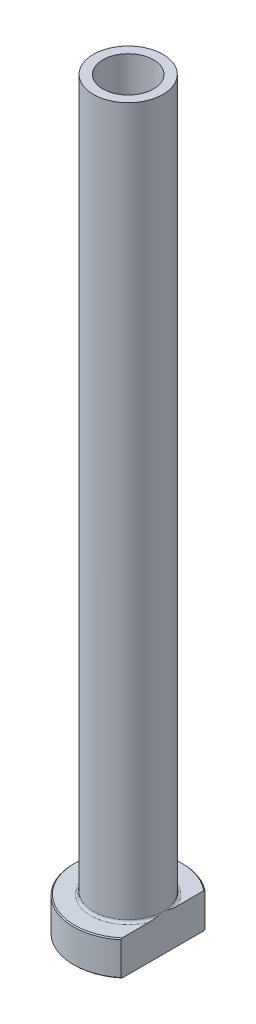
ISO-10303-21;
HEADER;
FILE_DESCRIPTION(('STEP AP214'),'2;1');
FILE_NAME('part.step','',(''),(''),'','','');
FILE_SCHEMA(('AUTOMOTIVE_DESIGN { 1 0 10303 214 1 1 1 1 }'));
ENDSEC;
DATA;
#1=APPLICATION_CONTEXT('core data for automotive mechanical design processes');
#2=APPLICATION_PROTOCOL_DEFINITION('international standard','automotive_design',2000,#1);
#3=PRODUCT_CONTEXT('',#1,'mechanical');
#4=PRODUCT('Part','Part','',(#3));
#5=PRODUCT_RELATED_PRODUCT_CATEGORY('part','',(#4));
#6=PRODUCT_DEFINITION_FORMATION('','',#4);
#7=PRODUCT_DEFINITION_CONTEXT('part definition',#1,'design');
#8=PRODUCT_DEFINITION('design','',#6,#7);
#9=PRODUCT_DEFINITION_SHAPE('','',#8);
#10=(LENGTH_UNIT() NAMED_UNIT(*) SI_UNIT(.MILLI.,.METRE.));
#11=(NAMED_UNIT(*) PLANE_ANGLE_UNIT() SI_UNIT($,.RADIAN.));
#12=(NAMED_UNIT(*) SI_UNIT($,.STERADIAN.) SOLID_ANGLE_UNIT());
#13=UNCERTAINTY_MEASURE_WITH_UNIT(LENGTH_MEASURE(1.E-05),#10,'distance_accuracy_value','');
#14=(GEOMETRIC_REPRESENTATION_CONTEXT(3) GLOBAL_UNCERTAINTY_ASSIGNED_CONTEXT((#13)) GLOBAL_UNIT_ASSIGNED_CONTEXT((#10,
#11,#12)) REPRESENTATION_CONTEXT('',''));
#15=CARTESIAN_POINT('',(0.,0.,0.));
#16=DIRECTION('',(0.,0.,1.));
#17=DIRECTION('',(1.,0.,0.));
#18=AXIS2_PLACEMENT_3D('',#15,#16,#17);
#19=CARTESIAN_POINT('',(0.,92.1876809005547,0.));
#20=DIRECTION('',(0.,1.,0.));
#21=DIRECTION('',(0.,0.,1.));
#22=AXIS2_PLACEMENT_3D('',#19,#20,#21);
#23=CYLINDRICAL_SURFACE('',#22,5.1);
#24=CARTESIAN_POINT('',(0.,150.,0.));
#25=DIRECTION('',(0.,1.,0.));
#26=DIRECTION('',(0.,0.,1.));
#27=AXIS2_PLACEMENT_3D('',#24,#25,#26);
#28=CIRCLE('',#27,5.1);
#29=CARTESIAN_POINT('',(0.,150.,5.1));
#30=VERTEX_POINT('',#29);
#31=EDGE_CURVE('E167',#30,#30,#28,.T.);
#32=ORIENTED_EDGE('',*,*,#31,.T.);
#33=EDGE_LOOP('',(#32));
#34=FACE_BOUND('',#33,.T.);
#35=CARTESIAN_POINT('',(0.,95.,0.));
#36=DIRECTION('',(0.,1.,0.));
#37=DIRECTION('',(0.,0.,1.));
#38=AXIS2_PLACEMENT_3D('',#35,#36,#37);
#39=CIRCLE('',#38,5.1);
#40=CARTESIAN_POINT('',(0.,95.,5.1));
#41=VERTEX_POINT('',#40);
#42=EDGE_CURVE('E170',#41,#41,#39,.T.);
#43=ORIENTED_EDGE('',*,*,#42,.F.);
#44=EDGE_LOOP('',(#43));
#45=FACE_BOUND('',#44,.T.);
#46=ADVANCED_FACE('F32',(#34,#45),#23,.F.);
#47=CARTESIAN_POINT('',(-5.1,150.,0.));
#48=DIRECTION('',(0.,1.,0.));
#49=DIRECTION('',(0.,0.,1.));
#50=AXIS2_PLACEMENT_3D('',#47,#48,#49);
#51=PLANE('',#50);
#52=CARTESIAN_POINT('',(0.,150.,0.));
#53=DIRECTION('',(0.,1.,0.));
#54=DIRECTION('',(0.,0.,1.));
#55=AXIS2_PLACEMENT_3D('',#52,#53,#54);
#56=CIRCLE('',#55,7.00000000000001);
#57=CARTESIAN_POINT('',(0.,150.,7.00000000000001));
#58=VERTEX_POINT('',#57);
#59=EDGE_CURVE('E174',#58,#58,#56,.T.);
#60=ORIENTED_EDGE('',*,*,#59,.T.);
#61=EDGE_LOOP('',(#60));
#62=FACE_BOUND('',#61,.T.);
#63=ORIENTED_EDGE('',*,*,#31,.F.);
#64=EDGE_LOOP('',(#63));
#65=FACE_BOUND('',#64,.T.);
#66=ADVANCED_FACE('F157',(#62,#65),#51,.T.);
#67=CARTESIAN_POINT('',(0.,92.1876809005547,0.));
#68=DIRECTION('',(0.,1.,0.));
#69=DIRECTION('',(0.,0.,1.));
#70=AXIS2_PLACEMENT_3D('',#67,#68,#69);
#71=CYLINDRICAL_SURFACE('',#70,7.);
#72=CARTESIAN_POINT('',(0.,7.50000000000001,0.));
#73=DIRECTION('',(0.,1.,0.));
#74=DIRECTION('',(0.,0.,1.));
#75=AXIS2_PLACEMENT_3D('',#72,#73,#74);
#76=CIRCLE('',#75,7.);
#77=CARTESIAN_POINT('',(7.,7.50000000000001,0.));
#78=VERTEX_POINT('',#77);
#79=EDGE_CURVE('E180',#78,#78,#76,.T.);
#80=ORIENTED_EDGE('',*,*,#79,.T.);
#81=EDGE_LOOP('',(#80));
#82=FACE_BOUND('',#81,.T.);
#83=ORIENTED_EDGE('',*,*,#59,.F.);
#84=EDGE_LOOP('',(#83));
#85=FACE_BOUND('',#84,.T.);
#86=ADVANCED_FACE('F162',(#82,#85),#71,.T.);
#87=CARTESIAN_POINT('',(-6.99999999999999,7.,0.));
#88=DIRECTION('',(0.,1.,0.));
#89=DIRECTION('',(0.,0.,1.));
#90=AXIS2_PLACEMENT_3D('',#87,#88,#89);
#91=PLANE('',#90);
#92=DIRECTION('',(0.,0.,1.));
#93=VECTOR('',#92,1.);
#94=CARTESIAN_POINT('',(6.99999999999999,7.,0.));
#95=LINE('',#94,#93);
#96=CARTESIAN_POINT('',(7.,7.,-8.22435407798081));
#97=VERTEX_POINT('',#96);
#98=CARTESIAN_POINT('',(6.99999999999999,7.,-2.69258240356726));
#99=VERTEX_POINT('',#98);
#100=EDGE_CURVE('E54',#97,#99,#95,.T.);
#101=ORIENTED_EDGE('',*,*,#100,.F.);
#102=CARTESIAN_POINT('',(0.,7.,0.));
#103=DIRECTION('',(0.,1.,0.));
#104=DIRECTION('',(0.,0.,1.));
#105=AXIS2_PLACEMENT_3D('',#102,#103,#104);
#106=CIRCLE('',#105,10.8);
#107=CARTESIAN_POINT('',(6.99999999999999,7.,8.22435407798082));
#108=VERTEX_POINT('',#107);
#109=EDGE_CURVE('E186',#97,#108,#106,.T.);
#110=ORIENTED_EDGE('',*,*,#109,.T.);
#111=CARTESIAN_POINT('',(6.99999999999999,7.,2.69258240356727));
#112=VERTEX_POINT('',#111);
#113=EDGE_CURVE('E134',#112,#108,#95,.T.);
#114=ORIENTED_EDGE('',*,*,#113,.F.);
#115=CARTESIAN_POINT('',(0.,7.,0.));
#116=DIRECTION('',(0.,1.,0.));
#117=DIRECTION('',(0.,0.,1.));
#118=AXIS2_PLACEMENT_3D('',#115,#116,#117);
#119=CIRCLE('',#118,7.5);
#120=EDGE_CURVE('E183',#112,#99,#119,.F.);
#121=ORIENTED_EDGE('',*,*,#120,.T.);
#122=EDGE_LOOP('',(#101,#110,#114,#121));
#123=FACE_BOUND('',#122,.T.);
#124=ADVANCED_FACE('F197',(#123),#91,.T.);
#125=CARTESIAN_POINT('',(0.,92.1876809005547,0.));
#126=DIRECTION('',(0.,1.,0.));
#127=DIRECTION('',(0.,0.,1.));
#128=AXIS2_PLACEMENT_3D('',#125,#126,#127);
#129=CYLINDRICAL_SURFACE('',#128,11.);
#130=DIRECTION('',(0.,-1.,0.));
#131=VECTOR('',#130,1.);
#132=CARTESIAN_POINT('',(6.99999999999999,150.,8.48528137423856));
#133=LINE('',#132,#131);
#134=CARTESIAN_POINT('',(6.99999999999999,6.79999999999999,8.48528137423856));
#135=VERTEX_POINT('',#134);
#136=CARTESIAN_POINT('',(6.99999999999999,0.200000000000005,8.48528137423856));
#137=VERTEX_POINT('',#136);
#138=EDGE_CURVE('E82',#135,#137,#133,.T.);
#139=ORIENTED_EDGE('',*,*,#138,.F.);
#140=CARTESIAN_POINT('',(0.,6.79999999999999,0.));
#141=DIRECTION('',(0.,1.,0.));
#142=DIRECTION('',(0.,0.,1.));
#143=AXIS2_PLACEMENT_3D('',#140,#141,#142);
#144=CIRCLE('',#143,11.);
#145=CARTESIAN_POINT('',(7.,6.79999999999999,-8.48528137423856));
#146=VERTEX_POINT('',#145);
#147=EDGE_CURVE('E95',#135,#146,#144,.F.);
#148=ORIENTED_EDGE('',*,*,#147,.T.);
#149=DIRECTION('',(0.,-1.,0.));
#150=VECTOR('',#149,1.);
#151=CARTESIAN_POINT('',(7.,150.,-8.48528137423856));
#152=LINE('',#151,#150);
#153=CARTESIAN_POINT('',(7.,0.200000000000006,-8.48528137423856));
#154=VERTEX_POINT('',#153);
#155=EDGE_CURVE('E192',#146,#154,#152,.T.);
#156=ORIENTED_EDGE('',*,*,#155,.T.);
#157=CARTESIAN_POINT('',(0.,0.200000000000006,0.));
#158=DIRECTION('',(0.,-1.,0.));
#159=DIRECTION('',(0.,0.,-1.));
#160=AXIS2_PLACEMENT_3D('',#157,#158,#159);
#161=CIRCLE('',#160,11.);
#162=EDGE_CURVE('E98',#154,#137,#161,.F.);
#163=ORIENTED_EDGE('',*,*,#162,.T.);
#164=EDGE_LOOP('',(#139,#148,#156,#163));
#165=FACE_BOUND('',#164,.T.);
#166=ADVANCED_FACE('F190',(#165),#129,.T.);
#167=CARTESIAN_POINT('',(-11.,0.,0.));
#168=DIRECTION('',(0.,-1.,0.));
#169=DIRECTION('',(0.,0.,-1.));
#170=AXIS2_PLACEMENT_3D('',#167,#168,#169);
#171=PLANE('',#170);
#172=CARTESIAN_POINT('',(0.,0.,0.));
#173=DIRECTION('',(0.,-1.,0.));
#174=DIRECTION('',(0.,0.,-1.));
#175=AXIS2_PLACEMENT_3D('',#172,#173,#174);
#176=CIRCLE('',#175,5.85000000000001);
#177=CARTESIAN_POINT('',(0.,0.,-5.85000000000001));
#178=VERTEX_POINT('',#177);
#179=EDGE_CURVE('E40',#178,#178,#176,.F.);
#180=ORIENTED_EDGE('',*,*,#179,.T.);
#181=EDGE_LOOP('',(#180));
#182=FACE_BOUND('',#181,.T.);
#183=DIRECTION('',(0.,0.,-1.));
#184=VECTOR('',#183,1.);
#185=CARTESIAN_POINT('',(6.99999999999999,0.,8.48528137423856));
#186=LINE('',#185,#184);
#187=CARTESIAN_POINT('',(6.99999999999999,0.,8.22435407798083));
#188=VERTEX_POINT('',#187);
#189=CARTESIAN_POINT('',(7.,0.,-8.22435407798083));
#190=VERTEX_POINT('',#189);
#191=EDGE_CURVE('E47',#188,#190,#186,.T.);
#192=ORIENTED_EDGE('',*,*,#191,.F.);
#193=CARTESIAN_POINT('',(0.,0.,0.));
#194=DIRECTION('',(0.,-1.,0.));
#195=DIRECTION('',(0.,0.,-1.));
#196=AXIS2_PLACEMENT_3D('',#193,#194,#195);
#197=CIRCLE('',#196,10.8);
#198=EDGE_CURVE('E92',#188,#190,#197,.T.);
#199=ORIENTED_EDGE('',*,*,#198,.T.);
#200=EDGE_LOOP('',(#192,#199));
#201=FACE_BOUND('',#200,.T.);
#202=ADVANCED_FACE('F91',(#182,#201),#171,.T.);
#203=CARTESIAN_POINT('',(0.,92.1876809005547,0.));
#204=DIRECTION('',(0.,1.,0.));
#205=DIRECTION('',(0.,0.,1.));
#206=AXIS2_PLACEMENT_3D('',#203,#204,#205);
#207=CYLINDRICAL_SURFACE('',#206,5.35);
#208=CARTESIAN_POINT('',(0.,0.500000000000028,0.));
#209=DIRECTION('',(0.,-1.,0.));
#210=DIRECTION('',(0.,0.,-1.));
#211=AXIS2_PLACEMENT_3D('',#208,#209,#210);
#212=CIRCLE('',#211,5.35);
#213=CARTESIAN_POINT('',(0.,0.500000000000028,-5.35));
#214=VERTEX_POINT('',#213);
#215=EDGE_CURVE('E11',#214,#214,#212,.T.);
#216=ORIENTED_EDGE('',*,*,#215,.T.);
#217=EDGE_LOOP('',(#216));
#218=FACE_BOUND('',#217,.T.);
#219=CARTESIAN_POINT('',(0.,83.,0.));
#220=DIRECTION('',(0.,1.,0.));
#221=DIRECTION('',(0.,0.,1.));
#222=AXIS2_PLACEMENT_3D('',#219,#220,#221);
#223=CIRCLE('',#222,5.35);
#224=CARTESIAN_POINT('',(0.,83.,5.35));
#225=VERTEX_POINT('',#224);
#226=EDGE_CURVE('E172',#225,#225,#223,.T.);
#227=ORIENTED_EDGE('',*,*,#226,.T.);
#228=EDGE_LOOP('',(#227));
#229=FACE_BOUND('',#228,.T.);
#230=ADVANCED_FACE('F215',(#218,#229),#207,.F.);
#231=CARTESIAN_POINT('',(0.,83.,0.));
#232=DIRECTION('',(0.,-1.,0.));
#233=DIRECTION('',(0.,0.,-1.));
#234=AXIS2_PLACEMENT_3D('',#231,#232,#233);
#235=CONICAL_SURFACE('',#234,5.35,0.0208303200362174);
#236=ORIENTED_EDGE('',*,*,#42,.T.);
#237=EDGE_LOOP('',(#236));
#238=FACE_BOUND('',#237,.T.);
#239=ORIENTED_EDGE('',*,*,#226,.F.);
#240=EDGE_LOOP('',(#239));
#241=FACE_BOUND('',#240,.T.);
#242=ADVANCED_FACE('F111',(#238,#241),#235,.F.);
#243=CARTESIAN_POINT('',(0.,7.50000000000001,0.));
#244=DIRECTION('',(0.,1.,0.));
#245=DIRECTION('',(0.,0.,1.));
#246=AXIS2_PLACEMENT_3D('',#243,#244,#245);
#247=TOROIDAL_SURFACE('',#246,7.5,0.5);
#248=ORIENTED_EDGE('',*,*,#120,.F.);
#249=CARTESIAN_POINT('',(7.,7.50000000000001,0.));
#250=CARTESIAN_POINT('',(7.,7.50000080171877,-1.25568479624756E-10));
#251=CARTESIAN_POINT('',(7.,7.50000160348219,2.9022028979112E-07));
#252=CARTESIAN_POINT('',(7.,7.50000310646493,1.10846445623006E-06));
#253=CARTESIAN_POINT('',(7.,7.50000379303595,1.65470117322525E-06));
#254=CARTESIAN_POINT('',(7.,7.50000521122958,2.96102760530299E-06));
#255=CARTESIAN_POINT('',(7.,7.50000592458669,3.74204187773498E-06));
#256=CARTESIAN_POINT('',(7.,7.50000721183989,5.36891885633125E-06));
#257=CARTESIAN_POINT('',(7.,7.50000778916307,6.21226355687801E-06));
#258=CARTESIAN_POINT('',(7.,7.50000990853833,9.44889721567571E-06));
#259=CARTESIAN_POINT('',(7.,7.50001133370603,1.19224915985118E-05));
#260=CARTESIAN_POINT('',(7.,7.50001370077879,1.68453050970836E-05));
#261=CARTESIAN_POINT('',(7.,7.50001467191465,1.92810864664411E-05));
#262=CARTESIAN_POINT('',(7.,7.5000187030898,2.95057529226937E-05));
#263=CARTESIAN_POINT('',(7.,7.50002167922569,3.73333827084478E-05));
#264=CARTESIAN_POINT('',(7.,7.5000261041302,5.21820419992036E-05));
#265=CARTESIAN_POINT('',(7.,7.50002771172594,5.91556020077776E-05));
#266=CARTESIAN_POINT('',(7.,7.50003935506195,0.000110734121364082));
#267=CARTESIAN_POINT('',(7.,7.50004810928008,0.000155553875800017));
#268=CARTESIAN_POINT('',(6.99999999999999,7.50008643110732,0.00033254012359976));
#269=CARTESIAN_POINT('',(6.99999999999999,7.50012307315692,0.000463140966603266));
#270=CARTESIAN_POINT('',(7.,7.50026565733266,0.000980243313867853));
#271=CARTESIAN_POINT('',(7.,7.50036696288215,0.00136762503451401));
#272=CARTESIAN_POINT('',(6.99999999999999,7.50077257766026,0.00290683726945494));
#273=CARTESIAN_POINT('',(6.99999999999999,7.5010826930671,0.00405753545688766));
#274=CARTESIAN_POINT('',(7.,7.50237341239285,0.00885983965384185));
#275=CARTESIAN_POINT('',(7.,7.50334676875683,0.0125128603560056));
#276=CARTESIAN_POINT('',(6.99999999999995,7.51627189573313,0.0610038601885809));
#277=CARTESIAN_POINT('',(6.99999999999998,7.52827280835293,0.105832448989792));
#278=CARTESIAN_POINT('',(7.00000000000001,7.551709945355,0.193693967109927));
#279=CARTESIAN_POINT('',(7.,7.56314936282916,0.236726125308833));
#280=CARTESIAN_POINT('',(6.99999999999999,7.58740418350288,0.328321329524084));
#281=CARTESIAN_POINT('',(6.99999999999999,7.60020832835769,0.376887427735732));
#282=CARTESIAN_POINT('',(7.,7.62578161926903,0.474605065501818));
#283=CARTESIAN_POINT('',(7.,7.63854879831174,0.523757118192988));
#284=CARTESIAN_POINT('',(6.99999999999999,7.66904753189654,0.642366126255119));
#285=CARTESIAN_POINT('',(7.,7.68665961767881,0.711854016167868));
#286=CARTESIAN_POINT('',(7.,7.72074501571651,0.849103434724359));
#287=CARTESIAN_POINT('',(7.,7.73723627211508,0.916860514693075));
#288=CARTESIAN_POINT('',(7.,7.79038156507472,1.1410421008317));
#289=CARTESIAN_POINT('',(7.,7.82528973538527,1.29788860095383));
#290=CARTESIAN_POINT('',(7.,7.88862298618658,1.61471917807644));
#291=CARTESIAN_POINT('',(7.,7.91697354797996,1.77471883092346));
#292=CARTESIAN_POINT('',(7.,7.95258292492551,2.02253505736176));
#293=CARTESIAN_POINT('',(7.,7.96355251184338,2.10981398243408));
#294=CARTESIAN_POINT('',(7.,7.98165287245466,2.28476193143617));
#295=CARTESIAN_POINT('',(7.,7.98878459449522,2.37243085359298));
#296=CARTESIAN_POINT('',(7.,7.99822919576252,2.54760327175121));
#297=CARTESIAN_POINT('',(7.,8.00056589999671,2.63510541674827));
#298=CARTESIAN_POINT('',(7.,7.99919996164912,2.81004074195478));
#299=CARTESIAN_POINT('',(7.,7.99550272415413,2.89747391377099));
#300=CARTESIAN_POINT('',(7.,7.98391011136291,3.02882076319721));
#301=CARTESIAN_POINT('',(7.,7.9789723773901,3.0729968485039));
#302=CARTESIAN_POINT('',(7.,7.96665453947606,3.16105400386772));
#303=CARTESIAN_POINT('',(7.,7.9592724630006,3.20493480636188));
#304=CARTESIAN_POINT('',(7.,7.94168688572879,3.29163191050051));
#305=CARTESIAN_POINT('',(7.,7.93151559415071,3.3344546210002));
#306=CARTESIAN_POINT('',(7.,7.90768392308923,3.41909658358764));
#307=CARTESIAN_POINT('',(7.,7.89402748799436,3.46091691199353));
#308=CARTESIAN_POINT('',(7.,7.86214701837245,3.54331777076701));
#309=CARTESIAN_POINT('',(7.,7.84387618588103,3.58388050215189));
#310=CARTESIAN_POINT('',(7.,7.80145892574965,3.66184445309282));
#311=CARTESIAN_POINT('',(7.,7.77733569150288,3.69925738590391));
#312=CARTESIAN_POINT('',(7.,7.73714014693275,3.74836513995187));
#313=CARTESIAN_POINT('',(7.,7.72423208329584,3.76263695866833));
#314=CARTESIAN_POINT('',(7.,7.69673765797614,3.78951670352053));
#315=CARTESIAN_POINT('',(7.,7.68215013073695,3.80212346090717));
#316=CARTESIAN_POINT('',(7.,7.65099843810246,3.82514624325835));
#317=CARTESIAN_POINT('',(7.,7.63441049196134,3.83553078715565));
#318=CARTESIAN_POINT('',(7.,7.59955798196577,3.8529401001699));
#319=CARTESIAN_POINT('',(7.,7.58129885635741,3.85997533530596));
#320=CARTESIAN_POINT('',(7.,7.54906837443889,3.86837810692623));
#321=CARTESIAN_POINT('',(7.,7.53536870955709,3.87079233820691));
#322=CARTESIAN_POINT('',(7.,7.50775756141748,3.87325240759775));
#323=CARTESIAN_POINT('',(7.,7.4938461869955,3.87329942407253));
#324=CARTESIAN_POINT('',(7.,7.46623771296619,3.87102093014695));
#325=CARTESIAN_POINT('',(7.,7.45254041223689,3.8686978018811));
#326=CARTESIAN_POINT('',(7.,7.42569741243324,3.86188775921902));
#327=CARTESIAN_POINT('',(7.,7.41255212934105,3.85739924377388));
#328=CARTESIAN_POINT('',(7.,7.3825931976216,3.84468786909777));
#329=CARTESIAN_POINT('',(7.,7.36610215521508,3.83570823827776));
#330=CARTESIAN_POINT('',(7.,7.33476729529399,3.81523202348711));
#331=CARTESIAN_POINT('',(7.,7.31992737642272,3.80372966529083));
#332=CARTESIAN_POINT('',(7.,7.28371925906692,3.77170797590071));
#333=CARTESIAN_POINT('',(7.,7.26356272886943,3.74983059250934));
#334=CARTESIAN_POINT('',(7.,7.22671696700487,3.70338283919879));
#335=CARTESIAN_POINT('',(7.,7.2100336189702,3.67880800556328));
#336=CARTESIAN_POINT('',(7.,7.18026553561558,3.62921731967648));
#337=CARTESIAN_POINT('',(7.,7.16704475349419,3.60428175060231));
#338=CARTESIAN_POINT('',(7.,7.14275069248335,3.55337478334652));
#339=CARTESIAN_POINT('',(7.,7.1316794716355,3.52740242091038));
#340=CARTESIAN_POINT('',(7.,7.10104499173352,3.44809573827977));
#341=CARTESIAN_POINT('',(7.,7.08424174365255,3.39369851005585));
#342=CARTESIAN_POINT('',(7.,7.05431378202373,3.27667221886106));
#343=CARTESIAN_POINT('',(7.,7.04191718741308,3.21386807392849));
#344=CARTESIAN_POINT('',(7.,7.02234605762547,3.08735184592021));
#345=CARTESIAN_POINT('',(7.,7.01518234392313,3.0236381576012));
#346=CARTESIAN_POINT('',(7.,7.00517826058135,2.8977900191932));
#347=CARTESIAN_POINT('',(7.,7.00221627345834,2.8356646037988));
#348=CARTESIAN_POINT('',(7.,6.99952325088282,2.71160626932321));
#349=CARTESIAN_POINT('',(7.,6.99977918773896,2.64967358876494));
#350=CARTESIAN_POINT('',(7.,7.00377761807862,2.49407814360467));
#351=CARTESIAN_POINT('',(7.,7.00924384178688,2.40046113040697));
#352=CARTESIAN_POINT('',(7.,7.02494106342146,2.21367396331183));
#353=CARTESIAN_POINT('',(7.,7.0351710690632,2.12050372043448));
#354=CARTESIAN_POINT('',(7.,7.05969765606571,1.93249035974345));
#355=CARTESIAN_POINT('',(7.,7.07408383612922,1.83765914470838));
#356=CARTESIAN_POINT('',(7.,7.1060330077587,1.6482934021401));
#357=CARTESIAN_POINT('',(7.,7.12360402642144,1.55376025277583));
#358=CARTESIAN_POINT('',(7.,7.16806468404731,1.33086107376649));
#359=CARTESIAN_POINT('',(7.,7.19601783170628,1.20270896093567));
#360=CARTESIAN_POINT('',(7.,7.25475947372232,0.948586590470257));
#361=CARTESIAN_POINT('',(7.,7.28551257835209,0.822607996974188));
#362=CARTESIAN_POINT('',(7.,7.33123897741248,0.64133402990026));
#363=CARTESIAN_POINT('',(7.,7.34543722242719,0.585840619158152));
#364=CARTESIAN_POINT('',(6.99999999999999,7.37418243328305,0.474686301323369));
#365=CARTESIAN_POINT('',(6.99999999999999,7.38873064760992,0.419025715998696));
#366=CARTESIAN_POINT('',(7.,7.41873357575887,0.305011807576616));
#367=CARTESIAN_POINT('',(7.,7.43419762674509,0.246660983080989));
#368=CARTESIAN_POINT('',(6.99999999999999,7.46502361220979,0.130933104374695));
#369=CARTESIAN_POINT('',(6.99999999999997,7.48038319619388,0.073555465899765));
#370=CARTESIAN_POINT('',(7.,7.49665455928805,0.0125077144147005));
#371=CARTESIAN_POINT('',(7.,7.49762931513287,0.00884956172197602));
#372=CARTESIAN_POINT('',(6.99999999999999,7.49892036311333,0.00404608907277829));
#373=CARTESIAN_POINT('',(6.99999999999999,7.49922940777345,0.00289935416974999));
#374=CARTESIAN_POINT('',(7.,7.49963371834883,0.00136508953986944));
#375=CARTESIAN_POINT('',(7.,7.49973476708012,0.000978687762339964));
#376=CARTESIAN_POINT('',(6.99999999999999,7.49987704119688,0.00046273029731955));
#377=CARTESIAN_POINT('',(6.99999999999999,7.4999136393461,0.000332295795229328));
#378=CARTESIAN_POINT('',(7.,7.49995192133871,0.000155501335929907));
#379=CARTESIAN_POINT('',(7.,7.49996067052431,0.000110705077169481));
#380=CARTESIAN_POINT('',(7.,7.49997230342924,5.91504871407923E-05));
#381=CARTESIAN_POINT('',(7.,7.49997390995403,5.21782476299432E-05));
#382=CARTESIAN_POINT('',(7.,7.49997833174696,3.73322821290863E-05));
#383=CARTESIAN_POINT('',(7.,7.49998130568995,2.95059555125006E-05));
#384=CARTESIAN_POINT('',(7.,7.49998533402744,1.92826357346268E-05));
#385=CARTESIAN_POINT('',(7.,7.49998630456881,1.68469531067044E-05));
#386=CARTESIAN_POINT('',(7.,7.49998867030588,1.19242379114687E-05));
#387=CARTESIAN_POINT('',(7.,7.49999009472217,9.45063101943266E-06));
#388=CARTESIAN_POINT('',(7.,7.49999221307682,6.21386478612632E-06));
#389=CARTESIAN_POINT('',(7.,7.4999927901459,5.37045339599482E-06));
#390=CARTESIAN_POINT('',(7.,7.49999407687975,3.74339717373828E-06));
#391=CARTESIAN_POINT('',(7.,7.49999478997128,2.96226879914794E-06));
#392=CARTESIAN_POINT('',(7.,7.49999620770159,1.65567359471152E-06));
#393=CARTESIAN_POINT('',(7.,7.49999689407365,1.10929204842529E-06));
#394=CARTESIAN_POINT('',(7.,7.49999839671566,2.90683225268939E-07));
#395=CARTESIAN_POINT('',(7.,7.49999919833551,1.25561410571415E-10));
#396=CARTESIAN_POINT('',(7.,7.50000000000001,0.));
#397=B_SPLINE_CURVE_WITH_KNOTS('',3,(#249,#250,#251,#252,#253,#254,#255,#256,#257,#258,#259,
#260,#261,#262,#263,#264,#265,#266,#267,#268,#269,#270,#271,#272,#273,#274,#275,#276,#277,#278,
#279,#280,#281,#282,#283,#284,#285,#286,#287,#288,#289,#290,#291,#292,#293,#294,#295,#296,#297,
#298,#299,#300,#301,#302,#303,#304,#305,#306,#307,#308,#309,#310,#311,#312,#313,#314,#315,#316,
#317,#318,#319,#320,#321,#322,#323,#324,#325,#326,#327,#328,#329,#330,#331,#332,#333,#334,#335,
#336,#337,#338,#339,#340,#341,#342,#343,#344,#345,#346,#347,#348,#349,#350,#351,#352,#353,#354,
#355,#356,#357,#358,#359,#360,#361,#362,#363,#364,#365,#366,#367,#368,#369,#370,#371,#372,#373,
#374,#375,#376,#377,#378,#379,#380,#381,#382,#383,#384,#385,#386,#387,#388,#389,#390,#391,#392,
#393,#394,#395,#396),.UNSPECIFIED.,.T.,.F.,(4,2,2,2,2,2,2,2,2,2,2,2,2,2,2,2,2,2,2,2,2,2,2,2,2,2,
2,2,2,2,2,2,2,2,2,2,2,2,2,2,2,2,2,2,2,2,2,2,2,2,2,2,2,2,2,2,2,2,2,2,2,2,2,2,2,2,2,2,2,2,2,2,2,
4),(0.,2.42201381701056E-06,5.0530479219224E-06,8.20814016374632E-06,1.12722920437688E-05,
1.98044004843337E-05,2.76642048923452E-05,5.27403832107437E-05,7.41830767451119E-05,
0.000211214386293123,0.000617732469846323,0.00181938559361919,0.00539412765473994,
0.016736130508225,0.155952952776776,0.2895341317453,0.440210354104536,0.592559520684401,
0.807611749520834,1.0168149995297,1.49878389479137,1.98598665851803,2.24981935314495,
2.5135868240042,2.77604050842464,3.03825922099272,3.17156039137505,3.3049693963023,
3.43689837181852,3.5686786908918,3.70185328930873,3.83450849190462,3.89212877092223,
3.94978928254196,4.00821928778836,4.06646549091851,4.10801107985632,4.14953598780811,
4.19101920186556,4.23253313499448,4.28854866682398,4.34469377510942,4.4334341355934,
4.52232362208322,4.60686785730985,4.69149264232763,4.86185145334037,5.05362927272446,
5.24580256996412,5.43229132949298,5.61802533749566,5.89918385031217,6.18028382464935,
6.46796485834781,6.75638131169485,7.14981284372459,7.53882346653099,7.71066604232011,
7.88325629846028,8.0643532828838,8.24254095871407,8.25389891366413,8.25746134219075,
8.25865995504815,8.25906595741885,8.25920291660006,8.25922435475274,8.25924942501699,
8.25925728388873,8.25926581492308,8.25926887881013,8.25927203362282,8.25927466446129,
8.25927708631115),.UNSPECIFIED.);
#398=EDGE_CURVE('E126',#112,#78,#397,.T.);
#399=ORIENTED_EDGE('',*,*,#398,.T.);
#400=ORIENTED_EDGE('',*,*,#79,.F.);
#401=CARTESIAN_POINT('',(7.,7.50000000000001,0.));
#402=CARTESIAN_POINT('',(7.,7.49999919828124,1.25569885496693E-10));
#403=CARTESIAN_POINT('',(7.,7.49999839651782,-2.90220288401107E-07));
#404=CARTESIAN_POINT('',(7.,7.49999689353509,-1.10846445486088E-06));
#405=CARTESIAN_POINT('',(7.,7.49999620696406,-1.65470117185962E-06));
#406=CARTESIAN_POINT('',(7.,7.49999478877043,-2.96102760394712E-06));
#407=CARTESIAN_POINT('',(7.,7.49999407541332,-3.7420418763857E-06));
#408=CARTESIAN_POINT('',(7.,7.49999278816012,-5.36891885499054E-06));
#409=CARTESIAN_POINT('',(7.,7.49999221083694,-6.2122635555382E-06));
#410=CARTESIAN_POINT('',(7.,7.49999009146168,-9.44889721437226E-06));
#411=CARTESIAN_POINT('',(7.,7.49998866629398,-1.19224915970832E-05));
#412=CARTESIAN_POINT('',(7.,7.49998629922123,-1.68453050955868E-05));
#413=CARTESIAN_POINT('',(7.,7.49998532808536,-1.92810864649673E-05));
#414=CARTESIAN_POINT('',(7.,7.49998129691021,-2.950575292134E-05));
#415=CARTESIAN_POINT('',(7.,7.49997832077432,-3.73333827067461E-05));
#416=CARTESIAN_POINT('',(7.,7.49997389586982,-5.21820419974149E-05));
#417=CARTESIAN_POINT('',(7.,7.49997228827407,-5.91556020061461E-05));
#418=CARTESIAN_POINT('',(7.,7.49996064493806,-0.000110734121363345));
#419=CARTESIAN_POINT('',(7.,7.49995189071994,-0.000155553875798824));
#420=CARTESIAN_POINT('',(6.99999999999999,7.49991356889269,-0.000332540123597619));
#421=CARTESIAN_POINT('',(6.99999999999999,7.49987692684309,-0.00046314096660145));
#422=CARTESIAN_POINT('',(7.,7.49973434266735,-0.000980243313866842));
#423=CARTESIAN_POINT('',(7.,7.49963303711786,-0.00136762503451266));
#424=CARTESIAN_POINT('',(6.99999999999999,7.49922742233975,-0.0029068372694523));
#425=CARTESIAN_POINT('',(6.99999999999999,7.49891730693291,-0.00405753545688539));
#426=CARTESIAN_POINT('',(7.,7.49762658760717,-0.00885983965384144));
#427=CARTESIAN_POINT('',(7.,7.49665323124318,-0.0125128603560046));
#428=CARTESIAN_POINT('',(6.99999999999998,7.48372810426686,-0.0610038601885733));
#429=CARTESIAN_POINT('',(6.99999999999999,7.47172719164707,-0.105832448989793));
#430=CARTESIAN_POINT('',(7.,7.44829005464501,-0.193693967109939));
#431=CARTESIAN_POINT('',(7.,7.43685063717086,-0.236726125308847));
#432=CARTESIAN_POINT('',(6.99999999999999,7.41259581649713,-0.328321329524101));
#433=CARTESIAN_POINT('',(7.,7.39979167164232,-0.376887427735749));
#434=CARTESIAN_POINT('',(7.,7.37421838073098,-0.474605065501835));
#435=CARTESIAN_POINT('',(7.,7.36145120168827,-0.523757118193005));
#436=CARTESIAN_POINT('',(7.,7.33095246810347,-0.642366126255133));
#437=CARTESIAN_POINT('',(7.,7.3133403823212,-0.711854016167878));
#438=CARTESIAN_POINT('',(7.,7.2792549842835,-0.849103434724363));
#439=CARTESIAN_POINT('',(7.,7.26276372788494,-0.916860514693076));
#440=CARTESIAN_POINT('',(7.,7.20961843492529,-1.1410421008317));
#441=CARTESIAN_POINT('',(7.,7.17471026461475,-1.29788860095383));
#442=CARTESIAN_POINT('',(7.,7.11137701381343,-1.61471917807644));
#443=CARTESIAN_POINT('',(7.,7.08302645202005,-1.77471883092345));
#444=CARTESIAN_POINT('',(7.,7.0474170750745,-2.02253505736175));
#445=CARTESIAN_POINT('',(7.,7.03644748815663,-2.10981398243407));
#446=CARTESIAN_POINT('',(7.,7.01834712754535,-2.28476193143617));
#447=CARTESIAN_POINT('',(7.,7.01121540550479,-2.37243085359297));
#448=CARTESIAN_POINT('',(7.,7.00177080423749,-2.5476032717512));
#449=CARTESIAN_POINT('',(7.,6.9994341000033,-2.63510541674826));
#450=CARTESIAN_POINT('',(7.,7.00080003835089,-2.81004074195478));
#451=CARTESIAN_POINT('',(7.,7.00449727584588,-2.89747391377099));
#452=CARTESIAN_POINT('',(7.,7.01608988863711,-3.02882076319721));
#453=CARTESIAN_POINT('',(7.,7.02102762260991,-3.0729968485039));
#454=CARTESIAN_POINT('',(7.,7.03334546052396,-3.16105400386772));
#455=CARTESIAN_POINT('',(7.,7.04072753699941,-3.20493480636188));
#456=CARTESIAN_POINT('',(7.,7.05831311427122,-3.29163191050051));
#457=CARTESIAN_POINT('',(7.,7.06848440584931,-3.3344546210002));
#458=CARTESIAN_POINT('',(7.,7.09231607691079,-3.41909658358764));
#459=CARTESIAN_POINT('',(7.,7.10597251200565,-3.46091691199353));
#460=CARTESIAN_POINT('',(7.,7.13785298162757,-3.54331777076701));
#461=CARTESIAN_POINT('',(7.,7.15612381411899,-3.58388050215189));
#462=CARTESIAN_POINT('',(7.,7.19854107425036,-3.66184445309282));
#463=CARTESIAN_POINT('',(7.,7.22266430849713,-3.69925738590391));
#464=CARTESIAN_POINT('',(7.,7.26285985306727,-3.74836513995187));
#465=CARTESIAN_POINT('',(7.,7.27576791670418,-3.76263695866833));
#466=CARTESIAN_POINT('',(7.,7.30326234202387,-3.78951670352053));
#467=CARTESIAN_POINT('',(7.,7.31784986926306,-3.80212346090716));
#468=CARTESIAN_POINT('',(7.,7.34900156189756,-3.82514624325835));
#469=CARTESIAN_POINT('',(7.,7.36558950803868,-3.83553078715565));
#470=CARTESIAN_POINT('',(7.,7.40044201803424,-3.8529401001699));
#471=CARTESIAN_POINT('',(7.,7.4187011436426,-3.85997533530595));
#472=CARTESIAN_POINT('',(7.,7.45093162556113,-3.86837810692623));
#473=CARTESIAN_POINT('',(7.,7.46463129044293,-3.87079233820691));
#474=CARTESIAN_POINT('',(7.,7.49224243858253,-3.87325240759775));
#475=CARTESIAN_POINT('',(7.,7.50615381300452,-3.87329942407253));
#476=CARTESIAN_POINT('',(7.,7.53376228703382,-3.87102093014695));
#477=CARTESIAN_POINT('',(7.,7.54745958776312,-3.8686978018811));
#478=CARTESIAN_POINT('',(7.,7.57430258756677,-3.86188775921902));
#479=CARTESIAN_POINT('',(7.,7.58744787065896,-3.85739924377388));
#480=CARTESIAN_POINT('',(7.,7.61740680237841,-3.84468786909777));
#481=CARTESIAN_POINT('',(7.,7.63389784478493,-3.83570823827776));
#482=CARTESIAN_POINT('',(7.,7.66523270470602,-3.81523202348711));
#483=CARTESIAN_POINT('',(7.,7.68007262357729,-3.80372966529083));
#484=CARTESIAN_POINT('',(7.,7.71628074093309,-3.77170797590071));
#485=CARTESIAN_POINT('',(7.,7.73643727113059,-3.74983059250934));
#486=CARTESIAN_POINT('',(7.,7.77328303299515,-3.70338283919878));
#487=CARTESIAN_POINT('',(7.,7.78996638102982,-3.67880800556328));
#488=CARTESIAN_POINT('',(7.,7.81973446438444,-3.62921731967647));
#489=CARTESIAN_POINT('',(7.,7.83295524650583,-3.6042817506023));
#490=CARTESIAN_POINT('',(7.,7.85724930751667,-3.55337478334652));
#491=CARTESIAN_POINT('',(7.,7.86832052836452,-3.52740242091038));
#492=CARTESIAN_POINT('',(7.,7.89895500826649,-3.44809573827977));
#493=CARTESIAN_POINT('',(7.,7.91575825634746,-3.39369851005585));
#494=CARTESIAN_POINT('',(7.,7.94568621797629,-3.27667221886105));
#495=CARTESIAN_POINT('',(7.,7.95808281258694,-3.21386807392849));
#496=CARTESIAN_POINT('',(7.,7.97765394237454,-3.0873518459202));
#497=CARTESIAN_POINT('',(7.,7.98481765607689,-3.02363815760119));
#498=CARTESIAN_POINT('',(7.,7.99482173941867,-2.89779001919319));
#499=CARTESIAN_POINT('',(7.,7.99778372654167,-2.83566460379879));
#500=CARTESIAN_POINT('',(7.,8.0004767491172,-2.71160626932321));
#501=CARTESIAN_POINT('',(7.,8.00022081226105,-2.64967358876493));
#502=CARTESIAN_POINT('',(7.,7.99622238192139,-2.49407814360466));
#503=CARTESIAN_POINT('',(7.,7.99075615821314,-2.40046113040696));
#504=CARTESIAN_POINT('',(7.,7.97505893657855,-2.21367396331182));
#505=CARTESIAN_POINT('',(7.,7.96482893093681,-2.12050372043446));
#506=CARTESIAN_POINT('',(7.,7.9403023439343,-1.93249035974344));
#507=CARTESIAN_POINT('',(7.,7.92591616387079,-1.83765914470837));
#508=CARTESIAN_POINT('',(7.,7.89396699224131,-1.64829340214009));
#509=CARTESIAN_POINT('',(7.,7.87639597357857,-1.55376025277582));
#510=CARTESIAN_POINT('',(7.,7.8319353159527,-1.33086107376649));
#511=CARTESIAN_POINT('',(7.,7.80398216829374,-1.20270896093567));
#512=CARTESIAN_POINT('',(7.,7.7452405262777,-0.948586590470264));
#513=CARTESIAN_POINT('',(7.,7.71448742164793,-0.822607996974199));
#514=CARTESIAN_POINT('',(7.,7.66876102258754,-0.641334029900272));
#515=CARTESIAN_POINT('',(7.,7.65456277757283,-0.585840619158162));
#516=CARTESIAN_POINT('',(6.99999999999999,7.62581756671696,-0.474686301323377));
#517=CARTESIAN_POINT('',(6.99999999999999,7.61126935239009,-0.419025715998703));
#518=CARTESIAN_POINT('',(7.,7.58126642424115,-0.305011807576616));
#519=CARTESIAN_POINT('',(7.,7.56580237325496,-0.246660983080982));
#520=CARTESIAN_POINT('',(6.99999999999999,7.53497638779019,-0.130933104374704));
#521=CARTESIAN_POINT('',(6.99999999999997,7.519616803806,-0.0735554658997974));
#522=CARTESIAN_POINT('',(7.,7.50334544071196,-0.0125077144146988));
#523=CARTESIAN_POINT('',(7.,7.50237068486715,-0.00884956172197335));
#524=CARTESIAN_POINT('',(6.99999999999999,7.50107963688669,-0.00404608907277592));
#525=CARTESIAN_POINT('',(6.99999999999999,7.50077059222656,-0.00289935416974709));
#526=CARTESIAN_POINT('',(7.,7.50036628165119,-0.00136508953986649));
#527=CARTESIAN_POINT('',(7.,7.50026523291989,-0.000978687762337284));
#528=CARTESIAN_POINT('',(6.99999999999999,7.50012295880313,-0.000462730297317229));
#529=CARTESIAN_POINT('',(6.99999999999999,7.50008636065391,-0.000332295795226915));
#530=CARTESIAN_POINT('',(7.,7.50004807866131,-0.000155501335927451));
#531=CARTESIAN_POINT('',(7.,7.50003932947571,-0.000110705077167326));
#532=CARTESIAN_POINT('',(7.,7.50002769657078,-5.91504871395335E-05));
#533=CARTESIAN_POINT('',(7.,7.50002609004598,-5.21782476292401E-05));
#534=CARTESIAN_POINT('',(7.,7.50002166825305,-3.73322821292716E-05));
#535=CARTESIAN_POINT('',(7.,7.50001869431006,-2.95059555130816E-05));
#536=CARTESIAN_POINT('',(7.,7.50001466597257,-1.9282635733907E-05));
#537=CARTESIAN_POINT('',(7.,7.5000136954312,-1.68469531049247E-05));
#538=CARTESIAN_POINT('',(7.,7.50001132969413,-1.19242379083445E-05));
#539=CARTESIAN_POINT('',(7.,7.50000990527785,-9.45063101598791E-06));
#540=CARTESIAN_POINT('',(7.,7.50000778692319,-6.21386478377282E-06));
#541=CARTESIAN_POINT('',(7.,7.50000720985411,-5.3704533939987E-06));
#542=CARTESIAN_POINT('',(7.,7.50000592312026,-3.74339717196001E-06));
#543=CARTESIAN_POINT('',(7.,7.50000521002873,-2.96226879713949E-06));
#544=CARTESIAN_POINT('',(7.,7.50000379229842,-1.65567359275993E-06));
#545=CARTESIAN_POINT('',(7.,7.50000310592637,-1.10929204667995E-06));
#546=CARTESIAN_POINT('',(7.,7.50000160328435,-2.9068322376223E-07));
#547=CARTESIAN_POINT('',(7.,7.5000008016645,-1.25559954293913E-10));
#548=CARTESIAN_POINT('',(7.,7.50000000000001,0.));
#549=B_SPLINE_CURVE_WITH_KNOTS('',3,(#401,#402,#403,#404,#405,#406,#407,#408,#409,#410,#411,
#412,#413,#414,#415,#416,#417,#418,#419,#420,#421,#422,#423,#424,#425,#426,#427,#428,#429,#430,
#431,#432,#433,#434,#435,#436,#437,#438,#439,#440,#441,#442,#443,#444,#445,#446,#447,#448,#449,
#450,#451,#452,#453,#454,#455,#456,#457,#458,#459,#460,#461,#462,#463,#464,#465,#466,#467,#468,
#469,#470,#471,#472,#473,#474,#475,#476,#477,#478,#479,#480,#481,#482,#483,#484,#485,#486,#487,
#488,#489,#490,#491,#492,#493,#494,#495,#496,#497,#498,#499,#500,#501,#502,#503,#504,#505,#506,
#507,#508,#509,#510,#511,#512,#513,#514,#515,#516,#517,#518,#519,#520,#521,#522,#523,#524,#525,
#526,#527,#528,#529,#530,#531,#532,#533,#534,#535,#536,#537,#538,#539,#540,#541,#542,#543,#544,
#545,#546,#547,#548),.UNSPECIFIED.,.T.,.F.,(4,2,2,2,2,2,2,2,2,2,2,2,2,2,2,2,2,2,2,2,2,2,2,2,2,2,
2,2,2,2,2,2,2,2,2,2,2,2,2,2,2,2,2,2,2,2,2,2,2,2,2,2,2,2,2,2,2,2,2,2,2,2,2,2,2,2,2,2,2,2,2,2,2,
4),(0.,2.42201381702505E-06,5.05304792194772E-06,8.20814016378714E-06,1.12722920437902E-05,
1.98044004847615E-05,2.7664204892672E-05,5.27403832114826E-05,7.41830767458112E-05,
0.000211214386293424,0.000617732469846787,0.00181938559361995,0.00539412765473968,
0.0167361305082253,0.155952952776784,0.289534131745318,0.440210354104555,0.592559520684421,
0.807611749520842,1.0168149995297,1.49878389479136,1.98598665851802,2.24981935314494,
2.5135868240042,2.77604050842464,3.03825922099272,3.17156039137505,3.3049693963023,
3.43689837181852,3.5686786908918,3.70185328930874,3.83450849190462,3.89212877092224,
3.94978928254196,4.00821928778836,4.06646549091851,4.10801107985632,4.14953598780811,
4.19101920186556,4.23253313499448,4.28854866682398,4.34469377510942,4.4334341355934,
4.52232362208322,4.60686785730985,4.69149264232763,4.86185145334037,5.05362927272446,
5.24580256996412,5.43229132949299,5.61802533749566,5.89918385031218,6.18028382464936,
6.46796485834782,6.75638131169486,7.14981284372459,7.53882346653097,7.7106660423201,
7.88325629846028,8.0643532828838,8.24254095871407,8.25389891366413,8.25746134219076,
8.25865995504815,8.25906595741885,8.25920291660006,8.25922435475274,8.25924942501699,
8.25925728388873,8.25926581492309,8.25926887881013,8.25927203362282,8.25927466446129,
8.25927708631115),.UNSPECIFIED.);
#550=EDGE_CURVE('E135',#78,#99,#549,.T.);
#551=ORIENTED_EDGE('',*,*,#550,.T.);
#552=EDGE_LOOP('',(#248,#399,#400,#551));
#553=FACE_BOUND('',#552,.T.);
#554=ADVANCED_FACE('F141',(#553),#247,.F.);
#555=CARTESIAN_POINT('',(0.,7.00000000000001,0.));
#556=DIRECTION('',(0.,-1.,0.));
#557=DIRECTION('',(0.,0.,-1.));
#558=AXIS2_PLACEMENT_3D('',#555,#556,#557);
#559=CONICAL_SURFACE('',#558,10.8,0.785398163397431);
#560=CARTESIAN_POINT('',(7.,-2.13774979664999,-18.6685261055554));
#561=CARTESIAN_POINT('',(7.,-1.86574872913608,-18.3780244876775));
#562=CARTESIAN_POINT('',(7.,-1.59415659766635,-18.0871392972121));
#563=CARTESIAN_POINT('',(7.,-1.05192877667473,-17.5044755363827));
#564=CARTESIAN_POINT('',(7.,-0.781293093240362,-17.2126969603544));
#565=CARTESIAN_POINT('',(7.,-0.241050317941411,-16.628048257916));
#566=CARTESIAN_POINT('',(7.,0.0285564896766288,-16.3351778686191));
#567=CARTESIAN_POINT('',(7.,0.566485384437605,-15.7482616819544));
#568=CARTESIAN_POINT('',(7.,0.834807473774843,-15.4542158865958));
#569=CARTESIAN_POINT('',(7.,1.64198377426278,-14.5651645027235));
#570=CARTESIAN_POINT('',(7.,2.17856420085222,-13.9680841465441));
#571=CARTESIAN_POINT('',(7.,2.97696333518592,-13.0668144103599));
#572=CARTESIAN_POINT('',(7.,3.24199785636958,-12.7654727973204));
#573=CARTESIAN_POINT('',(7.,3.76945856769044,-12.1605141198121));
#574=CARTESIAN_POINT('',(7.,4.0318847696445,-11.856897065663));
#575=CARTESIAN_POINT('',(7.,4.50733797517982,-11.3009625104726));
#576=CARTESIAN_POINT('',(7.,4.7208802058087,-11.0490858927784));
#577=CARTESIAN_POINT('',(7.,5.14538078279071,-10.5431655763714));
#578=CARTESIAN_POINT('',(7.,5.35633915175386,-10.2891218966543));
#579=CARTESIAN_POINT('',(7.,5.77522964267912,-9.77836737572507));
#580=CARTESIAN_POINT('',(7.,5.98316044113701,-9.52165544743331));
#581=CARTESIAN_POINT('',(7.,6.39521098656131,-9.0051908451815));
#582=CARTESIAN_POINT('',(7.,6.59933078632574,-8.74543821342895));
#583=CARTESIAN_POINT('',(7.,7.0024344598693,-8.22283607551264));
#584=CARTESIAN_POINT('',(7.,7.20142819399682,-7.9599941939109));
#585=CARTESIAN_POINT('',(7.,7.59353840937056,-7.42991856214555));
#586=CARTESIAN_POINT('',(7.,7.7866544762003,-7.16268450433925));
#587=CARTESIAN_POINT('',(7.,8.16523718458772,-6.62311113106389));
#588=CARTESIAN_POINT('',(7.,8.35070911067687,-6.35077553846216));
#589=CARTESIAN_POINT('',(7.,8.71189725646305,-5.79973731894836));
#590=CARTESIAN_POINT('',(7.,8.88761537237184,-5.52103594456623));
#591=CARTESIAN_POINT('',(7.,9.19554959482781,-5.00707921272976));
#592=CARTESIAN_POINT('',(7.,9.32988075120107,-4.7730966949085));
#593=CARTESIAN_POINT('',(7.,9.58764253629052,-4.29911523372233));
#594=CARTESIAN_POINT('',(7.,9.71107181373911,-4.05911554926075));
#595=CARTESIAN_POINT('',(7.,9.94390907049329,-3.57263619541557));
#596=CARTESIAN_POINT('',(7.,10.0533307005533,-3.32616312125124));
#597=CARTESIAN_POINT('',(7.,10.2545146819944,-2.8260716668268));
#598=CARTESIAN_POINT('',(7.,10.3462820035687,-2.57245532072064));
#599=CARTESIAN_POINT('',(7.,10.4907049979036,-2.11254447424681));
#600=CARTESIAN_POINT('',(7.,10.5475277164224,-1.90756611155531));
#601=CARTESIAN_POINT('',(7.,10.6452043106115,-1.49381161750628));
#602=CARTESIAN_POINT('',(7.,10.68606033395,-1.28503600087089));
#603=CARTESIAN_POINT('',(7.,10.749755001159,-0.865342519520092));
#604=CARTESIAN_POINT('',(7.,10.772646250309,-0.65443275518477));
#605=CARTESIAN_POINT('',(7.,10.7993569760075,-0.231396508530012));
#606=CARTESIAN_POINT('',(7.,10.8031771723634,-0.0192700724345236));
#607=CARTESIAN_POINT('',(7.,10.791517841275,0.40471508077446));
#608=CARTESIAN_POINT('',(7.,10.7760135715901,0.616573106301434));
#609=CARTESIAN_POINT('',(7.,10.726541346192,1.03810446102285));
#610=CARTESIAN_POINT('',(7.,10.6925718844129,1.24777761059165));
#611=CARTESIAN_POINT('',(7.,10.6077703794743,1.66430273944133));
#612=CARTESIAN_POINT('',(7.,10.5568873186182,1.87114418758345));
#613=CARTESIAN_POINT('',(7.,10.4404729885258,2.28061279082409));
#614=CARTESIAN_POINT('',(7.,10.3749414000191,2.48323985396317));
#615=CARTESIAN_POINT('',(7.,10.2190980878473,2.91860265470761));
#616=CARTESIAN_POINT('',(7.,10.126461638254,3.15050038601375));
#617=CARTESIAN_POINT('',(7.,9.92740958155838,3.60835455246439));
#618=CARTESIAN_POINT('',(7.,9.82098769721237,3.83430822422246));
#619=CARTESIAN_POINT('',(7.,9.596951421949,4.28105341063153));
#620=CARTESIAN_POINT('',(6.99999999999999,9.4793176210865,4.50183511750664));
#621=CARTESIAN_POINT('',(6.99999999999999,9.23524231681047,4.93840249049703));
#622=CARTESIAN_POINT('',(6.99999999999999,9.10880204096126,5.15418884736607));
#623=CARTESIAN_POINT('',(6.99999999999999,8.8471465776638,5.58417945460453));
#624=CARTESIAN_POINT('',(6.99999999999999,8.71183920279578,5.79832734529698));
#625=CARTESIAN_POINT('',(6.99999999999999,8.43533082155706,6.2227763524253));
#626=CARTESIAN_POINT('',(6.99999999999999,8.29412966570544,6.43307737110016));
#627=CARTESIAN_POINT('',(6.99999999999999,8.00706556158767,6.8501400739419));
#628=CARTESIAN_POINT('',(6.99999999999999,7.86120763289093,7.05690522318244));
#629=CARTESIAN_POINT('',(6.99999999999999,7.56553131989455,7.46757278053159));
#630=CARTESIAN_POINT('',(6.99999999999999,7.41571298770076,7.67147522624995));
#631=CARTESIAN_POINT('',(6.99999999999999,7.07999705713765,8.12067189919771));
#632=CARTESIAN_POINT('',(6.99999999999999,6.893308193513,8.36537403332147));
#633=CARTESIAN_POINT('',(6.99999999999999,6.51597189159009,8.85171196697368));
#634=CARTESIAN_POINT('',(6.99999999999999,6.32532432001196,9.09334766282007));
#635=CARTESIAN_POINT('',(6.99999999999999,5.94076020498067,9.57404667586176));
#636=CARTESIAN_POINT('',(6.99999999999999,5.74684327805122,9.813109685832));
#637=CARTESIAN_POINT('',(6.99999999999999,5.35630729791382,10.2890203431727));
#638=CARTESIAN_POINT('',(6.99999999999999,5.15968820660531,10.5258679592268));
#639=CARTESIAN_POINT('',(6.99999999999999,4.56606953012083,11.2340330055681));
#640=CARTESIAN_POINT('',(6.99999999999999,4.16568148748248,11.7025100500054));
#641=CARTESIAN_POINT('',(6.99999999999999,3.35840033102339,12.6338245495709));
#642=CARTESIAN_POINT('',(6.99999999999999,2.95150704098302,13.0966618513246));
#643=CARTESIAN_POINT('',(6.99999999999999,2.35017562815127,13.773410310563));
#644=CARTESIAN_POINT('',(6.99999999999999,2.15763812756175,13.9890143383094));
#645=CARTESIAN_POINT('',(6.99999999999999,1.7716160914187,14.4193671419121));
#646=CARTESIAN_POINT('',(6.99999999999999,1.57813157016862,14.6341159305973));
#647=CARTESIAN_POINT('',(6.99999999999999,0.996412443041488,15.2772388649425));
#648=CARTESIAN_POINT('',(6.99999999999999,0.606922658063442,15.7044779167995));
#649=CARTESIAN_POINT('',(6.99999999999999,-0.173895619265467,16.5556520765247));
#650=CARTESIAN_POINT('',(6.99999999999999,-0.565218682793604,16.9795921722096));
#651=CARTESIAN_POINT('',(6.99999999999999,-1.34999931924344,17.8254589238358));
#652=CARTESIAN_POINT('',(6.99999999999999,-1.74345679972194,18.2473856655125));
#653=CARTESIAN_POINT('',(6.99999999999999,-2.13774979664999,18.6685261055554));
#654=B_SPLINE_CURVE_WITH_KNOTS('',3,(#560,#561,#562,#563,#564,#565,#566,#567,#568,#569,#570,
#571,#572,#573,#574,#575,#576,#577,#578,#579,#580,#581,#582,#583,#584,#585,#586,#587,#588,#589,
#590,#591,#592,#593,#594,#595,#596,#597,#598,#599,#600,#601,#602,#603,#604,#605,#606,#607,#608,
#609,#610,#611,#612,#613,#614,#615,#616,#617,#618,#619,#620,#621,#622,#623,#624,#625,#626,#627,
#628,#629,#630,#631,#632,#633,#634,#635,#636,#637,#638,#639,#640,#641,#642,#643,#644,#645,#646,
#647,#648,#649,#650,#651,#652,#653),.UNSPECIFIED.,.F.,.F.,(4,2,2,2,2,2,2,2,2,2,2,2,2,2,2,2,2,2,
2,2,2,2,2,2,2,2,2,2,2,2,2,2,2,2,2,2,2,2,2,2,2,2,2,2,2,2,4),(0.,1.19389386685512,
2.38779531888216,3.58200567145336,4.77621398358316,7.18442154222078,8.38834194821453,
9.59225689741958,10.5828886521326,11.5735117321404,12.5645555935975,13.5555857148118,
14.5445404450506,15.5335647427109,16.5218934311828,17.5100293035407,18.3192088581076,
19.1284885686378,19.9369735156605,20.745230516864,21.3828127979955,22.020309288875,
22.6559319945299,23.2915307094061,23.9279440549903,24.5644093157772,25.2028120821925,
25.8412287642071,26.5898097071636,27.3387327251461,28.0889766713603,28.8391162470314,
29.5989369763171,30.3587769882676,31.1178239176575,31.8768608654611,32.8001653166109,
33.7235009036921,34.6469455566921,35.5704032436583,37.4191008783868,39.2678486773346,
40.1350269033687,41.0021920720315,42.7365692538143,44.467379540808,46.1981154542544),.UNSPECIFIED.);
#655=EDGE_CURVE('E133',#146,#97,#654,.T.);
#656=ORIENTED_EDGE('',*,*,#655,.F.);
#657=ORIENTED_EDGE('',*,*,#147,.F.);
#658=EDGE_CURVE('E118',#108,#135,#654,.T.);
#659=ORIENTED_EDGE('',*,*,#658,.F.);
#660=ORIENTED_EDGE('',*,*,#109,.F.);
#661=EDGE_LOOP('',(#656,#657,#659,#660));
#662=FACE_BOUND('',#661,.T.);
#663=ADVANCED_FACE('F145',(#662),#559,.T.);
#664=CARTESIAN_POINT('',(0.,0.200000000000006,0.));
#665=DIRECTION('',(0.,1.,0.));
#666=DIRECTION('',(0.,0.,1.));
#667=AXIS2_PLACEMENT_3D('',#664,#665,#666);
#668=CONICAL_SURFACE('',#667,11.,0.785398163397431);
#669=CARTESIAN_POINT('',(6.99999999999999,9.13774979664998,18.6685261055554));
#670=CARTESIAN_POINT('',(6.99999999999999,8.86574872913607,18.3780244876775));
#671=CARTESIAN_POINT('',(6.99999999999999,8.59415659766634,18.0871392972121));
#672=CARTESIAN_POINT('',(6.99999999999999,8.05192877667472,17.5044755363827));
#673=CARTESIAN_POINT('',(6.99999999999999,7.78129309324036,17.2126969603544));
#674=CARTESIAN_POINT('',(6.99999999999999,7.2410503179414,16.628048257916));
#675=CARTESIAN_POINT('',(6.99999999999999,6.97144351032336,16.3351778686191));
#676=CARTESIAN_POINT('',(6.99999999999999,6.43351461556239,15.7482616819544));
#677=CARTESIAN_POINT('',(6.99999999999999,6.16519252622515,15.4542158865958));
#678=CARTESIAN_POINT('',(6.99999999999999,5.35801622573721,14.5651645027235));
#679=CARTESIAN_POINT('',(6.99999999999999,4.82143579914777,13.9680841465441));
#680=CARTESIAN_POINT('',(6.99999999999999,4.02303666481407,13.0668144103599));
#681=CARTESIAN_POINT('',(6.99999999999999,3.75800214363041,12.7654727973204));
#682=CARTESIAN_POINT('',(6.99999999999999,3.23054143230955,12.1605141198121));
#683=CARTESIAN_POINT('',(6.99999999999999,2.96811523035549,11.856897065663));
#684=CARTESIAN_POINT('',(6.99999999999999,2.49266202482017,11.3009625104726));
#685=CARTESIAN_POINT('',(6.99999999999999,2.27911979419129,11.0490858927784));
#686=CARTESIAN_POINT('',(6.99999999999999,1.85461921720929,10.5431655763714));
#687=CARTESIAN_POINT('',(6.99999999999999,1.64366084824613,10.2891218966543));
#688=CARTESIAN_POINT('',(6.99999999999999,1.22477035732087,9.77836737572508));
#689=CARTESIAN_POINT('',(6.99999999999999,1.01683955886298,9.52165544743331));
#690=CARTESIAN_POINT('',(6.99999999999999,0.604789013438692,9.0051908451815));
#691=CARTESIAN_POINT('',(6.99999999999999,0.400669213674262,8.74543821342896));
#692=CARTESIAN_POINT('',(6.99999999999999,-0.00243445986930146,8.22283607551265));
#693=CARTESIAN_POINT('',(6.99999999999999,-0.201428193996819,7.95999419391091));
#694=CARTESIAN_POINT('',(6.99999999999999,-0.593538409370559,7.42991856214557));
#695=CARTESIAN_POINT('',(6.99999999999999,-0.786654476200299,7.16268450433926));
#696=CARTESIAN_POINT('',(6.99999999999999,-1.16523718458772,6.6231111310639));
#697=CARTESIAN_POINT('',(6.99999999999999,-1.35070911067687,6.35077553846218));
#698=CARTESIAN_POINT('',(6.99999999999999,-1.71189725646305,5.79973731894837));
#699=CARTESIAN_POINT('',(6.99999999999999,-1.88761537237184,5.52103594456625));
#700=CARTESIAN_POINT('',(6.99999999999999,-2.19554959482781,5.00707921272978));
#701=CARTESIAN_POINT('',(6.99999999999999,-2.32988075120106,4.77309669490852));
#702=CARTESIAN_POINT('',(6.99999999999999,-2.58764253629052,4.29911523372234));
#703=CARTESIAN_POINT('',(7.,-2.71107181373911,4.05911554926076));
#704=CARTESIAN_POINT('',(7.,-2.94390907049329,3.57263619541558));
#705=CARTESIAN_POINT('',(7.,-3.05333070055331,3.32616312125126));
#706=CARTESIAN_POINT('',(7.,-3.25451468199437,2.82607166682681));
#707=CARTESIAN_POINT('',(7.,-3.34628200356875,2.57245532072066));
#708=CARTESIAN_POINT('',(7.,-3.49070499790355,2.11254447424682));
#709=CARTESIAN_POINT('',(7.,-3.54752771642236,1.90756611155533));
#710=CARTESIAN_POINT('',(7.,-3.64520431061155,1.4938116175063));
#711=CARTESIAN_POINT('',(7.,-3.68606033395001,1.28503600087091));
#712=CARTESIAN_POINT('',(7.,-3.74975500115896,0.865342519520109));
#713=CARTESIAN_POINT('',(7.,-3.77264625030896,0.654432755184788));
#714=CARTESIAN_POINT('',(7.,-3.79935697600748,0.23139650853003));
#715=CARTESIAN_POINT('',(7.,-3.80317717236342,0.0192700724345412));
#716=CARTESIAN_POINT('',(7.,-3.79151784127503,-0.404715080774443));
#717=CARTESIAN_POINT('',(7.,-3.77601357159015,-0.616573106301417));
#718=CARTESIAN_POINT('',(7.,-3.72654134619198,-1.03810446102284));
#719=CARTESIAN_POINT('',(7.,-3.69257188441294,-1.24777761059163));
#720=CARTESIAN_POINT('',(7.,-3.60777037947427,-1.66430273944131));
#721=CARTESIAN_POINT('',(7.,-3.55688731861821,-1.87114418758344));
#722=CARTESIAN_POINT('',(7.,-3.44047298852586,-2.28061279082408));
#723=CARTESIAN_POINT('',(7.,-3.37494140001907,-2.48323985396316));
#724=CARTESIAN_POINT('',(7.,-3.21909808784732,-2.9186026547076));
#725=CARTESIAN_POINT('',(7.,-3.12646163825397,-3.15050038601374));
#726=CARTESIAN_POINT('',(7.,-2.9274095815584,-3.60835455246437));
#727=CARTESIAN_POINT('',(7.,-2.82098769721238,-3.83430822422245));
#728=CARTESIAN_POINT('',(7.,-2.59695142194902,-4.2810534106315));
#729=CARTESIAN_POINT('',(7.,-2.47931762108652,-4.50183511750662));
#730=CARTESIAN_POINT('',(7.,-2.23524231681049,-4.938402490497));
#731=CARTESIAN_POINT('',(7.,-2.10880204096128,-5.15418884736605));
#732=CARTESIAN_POINT('',(7.,-1.84714657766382,-5.5841794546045));
#733=CARTESIAN_POINT('',(7.,-1.7118392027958,-5.79832734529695));
#734=CARTESIAN_POINT('',(7.,-1.43533082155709,-6.22277635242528));
#735=CARTESIAN_POINT('',(7.,-1.29412966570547,-6.43307737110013));
#736=CARTESIAN_POINT('',(7.,-1.0070655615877,-6.85014007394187));
#737=CARTESIAN_POINT('',(7.,-0.861207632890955,-7.05690522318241));
#738=CARTESIAN_POINT('',(7.,-0.565531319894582,-7.46757278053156));
#739=CARTESIAN_POINT('',(7.,-0.415712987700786,-7.67147522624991));
#740=CARTESIAN_POINT('',(7.,-0.0799970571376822,-8.12067189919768));
#741=CARTESIAN_POINT('',(7.,0.106691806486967,-8.36537403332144));
#742=CARTESIAN_POINT('',(7.,0.484028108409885,-8.85171196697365));
#743=CARTESIAN_POINT('',(7.,0.674675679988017,-9.09334766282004));
#744=CARTESIAN_POINT('',(7.,1.05923979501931,-9.57404667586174));
#745=CARTESIAN_POINT('',(7.,1.25315672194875,-9.81310968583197));
#746=CARTESIAN_POINT('',(7.,1.64369270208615,-10.2890203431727));
#747=CARTESIAN_POINT('',(7.,1.84031179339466,-10.5258679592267));
#748=CARTESIAN_POINT('',(7.,2.43393046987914,-11.2340330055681));
#749=CARTESIAN_POINT('',(7.,2.83431851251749,-11.7025100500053));
#750=CARTESIAN_POINT('',(7.,3.64159966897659,-12.6338245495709));
#751=CARTESIAN_POINT('',(7.,4.04849295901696,-13.0966618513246));
#752=CARTESIAN_POINT('',(7.,4.64982437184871,-13.7734103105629));
#753=CARTESIAN_POINT('',(7.,4.84236187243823,-13.9890143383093));
#754=CARTESIAN_POINT('',(7.,5.22838390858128,-14.4193671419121));
#755=CARTESIAN_POINT('',(7.,5.42186842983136,-14.6341159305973));
#756=CARTESIAN_POINT('',(7.,6.00358755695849,-15.2772388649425));
#757=CARTESIAN_POINT('',(7.,6.39307734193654,-15.7044779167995));
#758=CARTESIAN_POINT('',(7.,7.17389561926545,-16.5556520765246));
#759=CARTESIAN_POINT('',(7.,7.56521868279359,-16.9795921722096));
#760=CARTESIAN_POINT('',(7.,8.34999931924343,-17.8254589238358));
#761=CARTESIAN_POINT('',(7.,8.74345679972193,-18.2473856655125));
#762=CARTESIAN_POINT('',(7.,9.13774979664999,-18.6685261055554));
#763=B_SPLINE_CURVE_WITH_KNOTS('',3,(#669,#670,#671,#672,#673,#674,#675,#676,#677,#678,#679,
#680,#681,#682,#683,#684,#685,#686,#687,#688,#689,#690,#691,#692,#693,#694,#695,#696,#697,#698,
#699,#700,#701,#702,#703,#704,#705,#706,#707,#708,#709,#710,#711,#712,#713,#714,#715,#716,#717,
#718,#719,#720,#721,#722,#723,#724,#725,#726,#727,#728,#729,#730,#731,#732,#733,#734,#735,#736,
#737,#738,#739,#740,#741,#742,#743,#744,#745,#746,#747,#748,#749,#750,#751,#752,#753,#754,#755,
#756,#757,#758,#759,#760,#761,#762),.UNSPECIFIED.,.F.,.F.,(4,2,2,2,2,2,2,2,2,2,2,2,2,2,2,2,2,2,
2,2,2,2,2,2,2,2,2,2,2,2,2,2,2,2,2,2,2,2,2,2,2,2,2,2,2,2,4),(0.,1.19389386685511,
2.38779531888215,3.58200567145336,4.77621398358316,7.18442154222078,8.38834194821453,
9.59225689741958,10.5828886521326,11.5735117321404,12.5645555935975,13.5555857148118,
14.5445404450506,15.5335647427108,16.5218934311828,17.5100293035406,18.3192088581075,
19.1284885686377,19.9369735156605,20.745230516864,21.3828127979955,22.020309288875,
22.6559319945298,23.2915307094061,23.9279440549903,24.5644093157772,25.2028120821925,
25.8412287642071,26.5898097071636,27.3387327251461,28.0889766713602,28.8391162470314,
29.5989369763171,30.3587769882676,31.1178239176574,31.8768608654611,32.8001653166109,
33.723500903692,34.6469455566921,35.5704032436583,37.4191008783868,39.2678486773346,
40.1350269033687,41.0021920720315,42.7365692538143,44.467379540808,46.1981154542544),.UNSPECIFIED.);
#764=EDGE_CURVE('E79',#137,#188,#763,.T.);
#765=ORIENTED_EDGE('',*,*,#764,.F.);
#766=ORIENTED_EDGE('',*,*,#162,.F.);
#767=EDGE_CURVE('E87',#190,#154,#763,.T.);
#768=ORIENTED_EDGE('',*,*,#767,.F.);
#769=ORIENTED_EDGE('',*,*,#198,.F.);
#770=EDGE_LOOP('',(#765,#766,#768,#769));
#771=FACE_BOUND('',#770,.T.);
#772=ADVANCED_FACE('F94',(#771),#668,.T.);
#773=CARTESIAN_POINT('',(6.99999999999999,150.,8.48528137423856));
#774=DIRECTION('',(-1.,0.,0.));
#775=DIRECTION('',(0.,0.,1.));
#776=AXIS2_PLACEMENT_3D('',#773,#774,#775);
#777=PLANE('',#776);
#778=ORIENTED_EDGE('',*,*,#398,.F.);
#779=ORIENTED_EDGE('',*,*,#113,.T.);
#780=ORIENTED_EDGE('',*,*,#658,.T.);
#781=ORIENTED_EDGE('',*,*,#138,.T.);
#782=ORIENTED_EDGE('',*,*,#764,.T.);
#783=ORIENTED_EDGE('',*,*,#191,.T.);
#784=ORIENTED_EDGE('',*,*,#767,.T.);
#785=ORIENTED_EDGE('',*,*,#155,.F.);
#786=ORIENTED_EDGE('',*,*,#655,.T.);
#787=ORIENTED_EDGE('',*,*,#100,.T.);
#788=ORIENTED_EDGE('',*,*,#550,.F.);
#789=EDGE_LOOP('',(#778,#779,#780,#781,#782,#783,#784,#785,#786,#787,#788));
#790=FACE_BOUND('',#789,.T.);
#791=ADVANCED_FACE('F80',(#790),#777,.F.);
#792=CARTESIAN_POINT('',(0.,0.,0.));
#793=DIRECTION('',(0.,-1.,0.));
#794=DIRECTION('',(0.,0.,-1.));
#795=AXIS2_PLACEMENT_3D('',#792,#793,#794);
#796=CONICAL_SURFACE('',#795,5.85000000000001,0.785398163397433);
#797=ORIENTED_EDGE('',*,*,#215,.F.);
#798=EDGE_LOOP('',(#797));
#799=FACE_BOUND('',#798,.T.);
#800=ORIENTED_EDGE('',*,*,#179,.F.);
#801=EDGE_LOOP('',(#800));
#802=FACE_BOUND('',#801,.T.);
#803=ADVANCED_FACE('F34',(#799,#802),#796,.F.);
#804=CLOSED_SHELL('',(#46,#66,#86,#124,#166,#202,#230,#242,#554,#663,#772,#791,#803));
#805=MANIFOLD_SOLID_BREP('B2',#804);
#806=ADVANCED_BREP_SHAPE_REPRESENTATION('',(#18,#805),#14);
#807=SHAPE_DEFINITION_REPRESENTATION(#9,#806);
ENDSEC;
END-ISO-10303-21;
